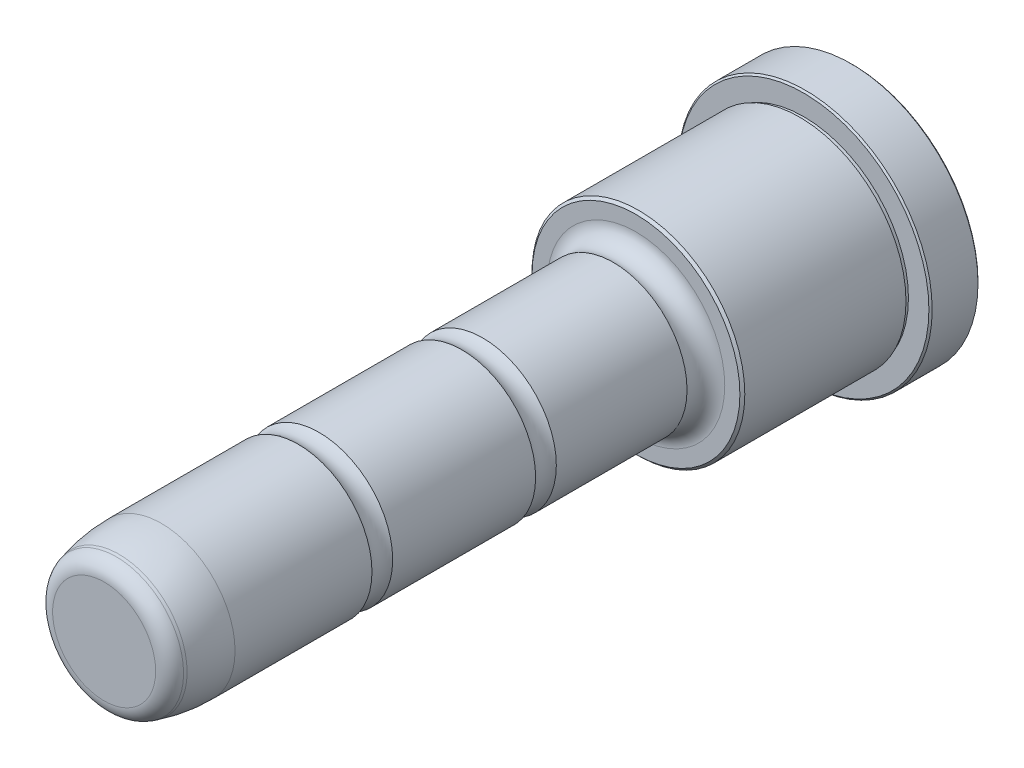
ISO-10303-21;
HEADER;
FILE_DESCRIPTION(('STEP AP214'),'2;1');
FILE_NAME('part.step','',(''),(''),'','','');
FILE_SCHEMA(('AUTOMOTIVE_DESIGN { 1 0 10303 214 1 1 1 1 }'));
ENDSEC;
DATA;
#1=APPLICATION_CONTEXT('core data for automotive mechanical design processes');
#2=APPLICATION_PROTOCOL_DEFINITION('international standard','automotive_design',2000,#1);
#3=PRODUCT_CONTEXT('',#1,'mechanical');
#4=PRODUCT('Part','Part','',(#3));
#5=PRODUCT_RELATED_PRODUCT_CATEGORY('part','',(#4));
#6=PRODUCT_DEFINITION_FORMATION('','',#4);
#7=PRODUCT_DEFINITION_CONTEXT('part definition',#1,'design');
#8=PRODUCT_DEFINITION('design','',#6,#7);
#9=PRODUCT_DEFINITION_SHAPE('','',#8);
#10=(LENGTH_UNIT() NAMED_UNIT(*) SI_UNIT(.MILLI.,.METRE.));
#11=(NAMED_UNIT(*) PLANE_ANGLE_UNIT() SI_UNIT($,.RADIAN.));
#12=(NAMED_UNIT(*) SI_UNIT($,.STERADIAN.) SOLID_ANGLE_UNIT());
#13=UNCERTAINTY_MEASURE_WITH_UNIT(LENGTH_MEASURE(1.E-05),#10,'distance_accuracy_value','');
#14=(GEOMETRIC_REPRESENTATION_CONTEXT(3) GLOBAL_UNCERTAINTY_ASSIGNED_CONTEXT((#13)) GLOBAL_UNIT_ASSIGNED_CONTEXT((#10,
#11,#12)) REPRESENTATION_CONTEXT('',''));
#15=CARTESIAN_POINT('',(0.,0.,0.));
#16=DIRECTION('',(0.,0.,1.));
#17=DIRECTION('',(1.,0.,0.));
#18=AXIS2_PLACEMENT_3D('',#15,#16,#17);
#19=CARTESIAN_POINT('',(0.,0.,0.250000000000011));
#20=DIRECTION('',(0.,0.,1.));
#21=DIRECTION('',(1.,0.,0.));
#22=AXIS2_PLACEMENT_3D('',#19,#20,#21);
#23=CYLINDRICAL_SURFACE('',#22,8.99999999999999);
#24=CARTESIAN_POINT('',(0.,0.,29.5099342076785));
#25=DIRECTION('',(0.,0.,1.));
#26=DIRECTION('',(1.,0.,0.));
#27=AXIS2_PLACEMENT_3D('',#24,#25,#26);
#28=CIRCLE('',#27,9.);
#29=CARTESIAN_POINT('',(9.,0.,29.5099342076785));
#30=VERTEX_POINT('',#29);
#31=EDGE_CURVE('E10',#30,#30,#28,.T.);
#32=ORIENTED_EDGE('',*,*,#31,.T.);
#33=EDGE_LOOP('',(#32));
#34=FACE_BOUND('',#33,.T.);
#35=CARTESIAN_POINT('',(0.,0.,45.4850889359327));
#36=DIRECTION('',(0.,0.,1.));
#37=DIRECTION('',(1.,0.,0.));
#38=AXIS2_PLACEMENT_3D('',#35,#36,#37);
#39=CIRCLE('',#38,9.);
#40=CARTESIAN_POINT('',(9.,0.,45.4850889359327));
#41=VERTEX_POINT('',#40);
#42=EDGE_CURVE('E91',#41,#41,#39,.T.);
#43=ORIENTED_EDGE('',*,*,#42,.F.);
#44=EDGE_LOOP('',(#43));
#45=FACE_BOUND('',#44,.T.);
#46=ADVANCED_FACE('F32',(#34,#45),#23,.T.);
#47=CARTESIAN_POINT('',(0.,0.,28.75));
#48=DIRECTION('',(0.,0.,1.));
#49=DIRECTION('',(1.,0.,0.));
#50=AXIS2_PLACEMENT_3D('',#47,#48,#49);
#51=TOROIDAL_SURFACE('',#50,10.85,2.);
#52=ORIENTED_EDGE('',*,*,#31,.F.);
#53=EDGE_LOOP('',(#52));
#54=FACE_BOUND('',#53,.T.);
#55=CARTESIAN_POINT('',(0.,0.,26.75));
#56=DIRECTION('',(0.,0.,1.));
#57=DIRECTION('',(1.,0.,0.));
#58=AXIS2_PLACEMENT_3D('',#55,#56,#57);
#59=CIRCLE('',#58,10.85);
#60=CARTESIAN_POINT('',(10.85,0.,26.75));
#61=VERTEX_POINT('',#60);
#62=EDGE_CURVE('E82',#61,#61,#59,.T.);
#63=ORIENTED_EDGE('',*,*,#62,.T.);
#64=EDGE_LOOP('',(#63));
#65=FACE_BOUND('',#64,.T.);
#66=ADVANCED_FACE('F34',(#54,#65),#51,.F.);
#67=CARTESIAN_POINT('',(0.,0.,0.250000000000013));
#68=DIRECTION('',(0.,0.,1.));
#69=DIRECTION('',(1.,0.,0.));
#70=AXIS2_PLACEMENT_3D('',#67,#68,#69);
#71=PLANE('',#70);
#72=CARTESIAN_POINT('',(0.,0.,0.250000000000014));
#73=DIRECTION('',(0.,0.,1.));
#74=DIRECTION('',(1.,0.,0.));
#75=AXIS2_PLACEMENT_3D('',#72,#73,#74);
#76=CIRCLE('',#75,15.3);
#77=CARTESIAN_POINT('',(15.3,0.,0.250000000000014));
#78=VERTEX_POINT('',#77);
#79=EDGE_CURVE('E55',#78,#78,#76,.T.);
#80=ORIENTED_EDGE('',*,*,#79,.F.);
#81=EDGE_LOOP('',(#80));
#82=FACE_BOUND('',#81,.T.);
#83=ADVANCED_FACE('F122',(#82),#71,.F.);
#84=CARTESIAN_POINT('',(0.,0.,0.250000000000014));
#85=DIRECTION('',(0.,0.,1.));
#86=DIRECTION('',(1.,0.,0.));
#87=AXIS2_PLACEMENT_3D('',#84,#85,#86);
#88=CONICAL_SURFACE('',#87,15.3,0.785398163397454);
#89=CARTESIAN_POINT('',(0.,0.,0.450000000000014));
#90=DIRECTION('',(0.,0.,1.));
#91=DIRECTION('',(1.,0.,0.));
#92=AXIS2_PLACEMENT_3D('',#89,#90,#91);
#93=CIRCLE('',#92,15.5);
#94=CARTESIAN_POINT('',(15.5,0.,0.450000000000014));
#95=VERTEX_POINT('',#94);
#96=EDGE_CURVE('E58',#95,#95,#93,.T.);
#97=ORIENTED_EDGE('',*,*,#96,.F.);
#98=EDGE_LOOP('',(#97));
#99=FACE_BOUND('',#98,.T.);
#100=ORIENTED_EDGE('',*,*,#79,.T.);
#101=EDGE_LOOP('',(#100));
#102=FACE_BOUND('',#101,.T.);
#103=ADVANCED_FACE('F169',(#99,#102),#88,.T.);
#104=CARTESIAN_POINT('',(0.,0.,0.250000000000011));
#105=DIRECTION('',(0.,0.,1.));
#106=DIRECTION('',(1.,0.,0.));
#107=AXIS2_PLACEMENT_3D('',#104,#105,#106);
#108=CYLINDRICAL_SURFACE('',#107,15.5);
#109=CARTESIAN_POINT('',(0.,0.,6.05000000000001));
#110=DIRECTION('',(0.,0.,1.));
#111=DIRECTION('',(1.,0.,0.));
#112=AXIS2_PLACEMENT_3D('',#109,#110,#111);
#113=CIRCLE('',#112,15.5);
#114=CARTESIAN_POINT('',(15.5,0.,6.05000000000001));
#115=VERTEX_POINT('',#114);
#116=EDGE_CURVE('E61',#115,#115,#113,.T.);
#117=ORIENTED_EDGE('',*,*,#116,.F.);
#118=EDGE_LOOP('',(#117));
#119=FACE_BOUND('',#118,.T.);
#120=ORIENTED_EDGE('',*,*,#96,.T.);
#121=EDGE_LOOP('',(#120));
#122=FACE_BOUND('',#121,.T.);
#123=ADVANCED_FACE('F165',(#119,#122),#108,.T.);
#124=CARTESIAN_POINT('',(0.,0.,6.05000000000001));
#125=DIRECTION('',(0.,0.,-1.));
#126=DIRECTION('',(-1.,0.,0.));
#127=AXIS2_PLACEMENT_3D('',#124,#125,#126);
#128=CONICAL_SURFACE('',#127,15.5,0.785398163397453);
#129=CARTESIAN_POINT('',(0.,0.,6.25000000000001));
#130=DIRECTION('',(0.,0.,1.));
#131=DIRECTION('',(1.,0.,0.));
#132=AXIS2_PLACEMENT_3D('',#129,#130,#131);
#133=CIRCLE('',#132,15.3);
#134=CARTESIAN_POINT('',(15.3,0.,6.25000000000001));
#135=VERTEX_POINT('',#134);
#136=EDGE_CURVE('E64',#135,#135,#133,.T.);
#137=ORIENTED_EDGE('',*,*,#136,.F.);
#138=EDGE_LOOP('',(#137));
#139=FACE_BOUND('',#138,.T.);
#140=ORIENTED_EDGE('',*,*,#116,.T.);
#141=EDGE_LOOP('',(#140));
#142=FACE_BOUND('',#141,.T.);
#143=ADVANCED_FACE('F161',(#139,#142),#128,.T.);
#144=CARTESIAN_POINT('',(0.,15.3,6.25000000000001));
#145=DIRECTION('',(0.,0.,-1.));
#146=DIRECTION('',(-1.,0.,0.));
#147=AXIS2_PLACEMENT_3D('',#144,#145,#146);
#148=PLANE('',#147);
#149=CARTESIAN_POINT('',(0.,0.,6.25000000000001));
#150=DIRECTION('',(0.,0.,1.));
#151=DIRECTION('',(1.,0.,0.));
#152=AXIS2_PLACEMENT_3D('',#149,#150,#151);
#153=CIRCLE('',#152,12.8);
#154=CARTESIAN_POINT('',(12.8,0.,6.25000000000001));
#155=VERTEX_POINT('',#154);
#156=EDGE_CURVE('E67',#155,#155,#153,.T.);
#157=ORIENTED_EDGE('',*,*,#156,.F.);
#158=EDGE_LOOP('',(#157));
#159=FACE_BOUND('',#158,.T.);
#160=ORIENTED_EDGE('',*,*,#136,.T.);
#161=EDGE_LOOP('',(#160));
#162=FACE_BOUND('',#161,.T.);
#163=ADVANCED_FACE('F157',(#159,#162),#148,.F.);
#164=CARTESIAN_POINT('',(0.,0.,0.250000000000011));
#165=DIRECTION('',(0.,0.,1.));
#166=DIRECTION('',(1.,0.,0.));
#167=AXIS2_PLACEMENT_3D('',#164,#165,#166);
#168=CYLINDRICAL_SURFACE('',#167,12.8);
#169=CARTESIAN_POINT('',(0.,0.,6.75000000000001));
#170=DIRECTION('',(0.,0.,1.));
#171=DIRECTION('',(1.,0.,0.));
#172=AXIS2_PLACEMENT_3D('',#169,#170,#171);
#173=CIRCLE('',#172,12.8);
#174=CARTESIAN_POINT('',(12.8,0.,6.75000000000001));
#175=VERTEX_POINT('',#174);
#176=EDGE_CURVE('E70',#175,#175,#173,.T.);
#177=ORIENTED_EDGE('',*,*,#176,.F.);
#178=EDGE_LOOP('',(#177));
#179=FACE_BOUND('',#178,.T.);
#180=ORIENTED_EDGE('',*,*,#156,.T.);
#181=EDGE_LOOP('',(#180));
#182=FACE_BOUND('',#181,.T.);
#183=ADVANCED_FACE('F153',(#179,#182),#168,.T.);
#184=CARTESIAN_POINT('',(0.,12.8,6.75000000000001));
#185=DIRECTION('',(0.,0.,1.));
#186=DIRECTION('',(1.,0.,0.));
#187=AXIS2_PLACEMENT_3D('',#184,#185,#186);
#188=PLANE('',#187);
#189=CARTESIAN_POINT('',(0.,0.,6.75000000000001));
#190=DIRECTION('',(0.,0.,1.));
#191=DIRECTION('',(1.,0.,0.));
#192=AXIS2_PLACEMENT_3D('',#189,#190,#191);
#193=CIRCLE('',#192,13.);
#194=CARTESIAN_POINT('',(13.,0.,6.75000000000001));
#195=VERTEX_POINT('',#194);
#196=EDGE_CURVE('E73',#195,#195,#193,.T.);
#197=ORIENTED_EDGE('',*,*,#196,.F.);
#198=EDGE_LOOP('',(#197));
#199=FACE_BOUND('',#198,.T.);
#200=ORIENTED_EDGE('',*,*,#176,.T.);
#201=EDGE_LOOP('',(#200));
#202=FACE_BOUND('',#201,.T.);
#203=ADVANCED_FACE('F149',(#199,#202),#188,.F.);
#204=CARTESIAN_POINT('',(0.,0.,0.250000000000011));
#205=DIRECTION('',(0.,0.,1.));
#206=DIRECTION('',(1.,0.,0.));
#207=AXIS2_PLACEMENT_3D('',#204,#205,#206);
#208=CYLINDRICAL_SURFACE('',#207,13.);
#209=CARTESIAN_POINT('',(0.,0.,26.45));
#210=DIRECTION('',(0.,0.,1.));
#211=DIRECTION('',(1.,0.,0.));
#212=AXIS2_PLACEMENT_3D('',#209,#210,#211);
#213=CIRCLE('',#212,13.);
#214=CARTESIAN_POINT('',(13.,0.,26.45));
#215=VERTEX_POINT('',#214);
#216=EDGE_CURVE('E76',#215,#215,#213,.T.);
#217=ORIENTED_EDGE('',*,*,#216,.F.);
#218=EDGE_LOOP('',(#217));
#219=FACE_BOUND('',#218,.T.);
#220=ORIENTED_EDGE('',*,*,#196,.T.);
#221=EDGE_LOOP('',(#220));
#222=FACE_BOUND('',#221,.T.);
#223=ADVANCED_FACE('F145',(#219,#222),#208,.T.);
#224=CARTESIAN_POINT('',(0.,0.,26.45));
#225=DIRECTION('',(0.,0.,-1.));
#226=DIRECTION('',(-1.,0.,0.));
#227=AXIS2_PLACEMENT_3D('',#224,#225,#226);
#228=CONICAL_SURFACE('',#227,13.,0.785398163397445);
#229=CARTESIAN_POINT('',(0.,0.,26.75));
#230=DIRECTION('',(0.,0.,1.));
#231=DIRECTION('',(1.,0.,0.));
#232=AXIS2_PLACEMENT_3D('',#229,#230,#231);
#233=CIRCLE('',#232,12.7);
#234=CARTESIAN_POINT('',(12.7,0.,26.75));
#235=VERTEX_POINT('',#234);
#236=EDGE_CURVE('E79',#235,#235,#233,.T.);
#237=ORIENTED_EDGE('',*,*,#236,.F.);
#238=EDGE_LOOP('',(#237));
#239=FACE_BOUND('',#238,.T.);
#240=ORIENTED_EDGE('',*,*,#216,.T.);
#241=EDGE_LOOP('',(#240));
#242=FACE_BOUND('',#241,.T.);
#243=ADVANCED_FACE('F113',(#239,#242),#228,.T.);
#244=CARTESIAN_POINT('',(0.,12.7,26.75));
#245=DIRECTION('',(0.,0.,-1.));
#246=DIRECTION('',(-1.,0.,0.));
#247=AXIS2_PLACEMENT_3D('',#244,#245,#246);
#248=PLANE('',#247);
#249=ORIENTED_EDGE('',*,*,#62,.F.);
#250=EDGE_LOOP('',(#249));
#251=FACE_BOUND('',#250,.T.);
#252=ORIENTED_EDGE('',*,*,#236,.T.);
#253=EDGE_LOOP('',(#252));
#254=FACE_BOUND('',#253,.T.);
#255=ADVANCED_FACE('F103',(#251,#254),#248,.F.);
#256=CARTESIAN_POINT('',(0.,0.,46.75));
#257=DIRECTION('',(0.,0.,1.));
#258=DIRECTION('',(1.,0.,0.));
#259=AXIS2_PLACEMENT_3D('',#256,#257,#258);
#260=TOROIDAL_SURFACE('',#259,10.8000000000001,2.20000000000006);
#261=ORIENTED_EDGE('',*,*,#42,.T.);
#262=EDGE_LOOP('',(#261));
#263=FACE_BOUND('',#262,.T.);
#264=CARTESIAN_POINT('',(0.,0.,48.0149110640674));
#265=DIRECTION('',(0.,0.,1.));
#266=DIRECTION('',(1.,0.,0.));
#267=AXIS2_PLACEMENT_3D('',#264,#265,#266);
#268=CIRCLE('',#267,9.);
#269=CARTESIAN_POINT('',(9.,0.,48.0149110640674));
#270=VERTEX_POINT('',#269);
#271=EDGE_CURVE('E94',#270,#270,#268,.T.);
#272=ORIENTED_EDGE('',*,*,#271,.F.);
#273=EDGE_LOOP('',(#272));
#274=FACE_BOUND('',#273,.T.);
#275=ADVANCED_FACE('F100',(#263,#274),#260,.F.);
#276=CARTESIAN_POINT('',(0.,6.29522528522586,91.75));
#277=DIRECTION('',(0.,0.,-1.));
#278=DIRECTION('',(-1.,0.,0.));
#279=AXIS2_PLACEMENT_3D('',#276,#277,#278);
#280=PLANE('',#279);
#281=CARTESIAN_POINT('',(0.,0.,91.75));
#282=DIRECTION('',(0.,0.,1.));
#283=DIRECTION('',(1.,0.,0.));
#284=AXIS2_PLACEMENT_3D('',#281,#282,#283);
#285=CIRCLE('',#284,6.29522528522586);
#286=CARTESIAN_POINT('',(6.29522528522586,0.,91.75));
#287=VERTEX_POINT('',#286);
#288=EDGE_CURVE('E52',#287,#287,#285,.T.);
#289=ORIENTED_EDGE('',*,*,#288,.T.);
#290=EDGE_LOOP('',(#289));
#291=FACE_BOUND('',#290,.T.);
#292=ADVANCED_FACE('F102',(#291),#280,.F.);
#293=CARTESIAN_POINT('',(0.,0.,89.75));
#294=DIRECTION('',(0.,0.,1.));
#295=DIRECTION('',(1.,0.,0.));
#296=AXIS2_PLACEMENT_3D('',#293,#294,#295);
#297=TOROIDAL_SURFACE('',#296,6.29522528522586,2.00000000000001);
#298=ORIENTED_EDGE('',*,*,#288,.F.);
#299=EDGE_LOOP('',(#298));
#300=FACE_BOUND('',#299,.T.);
#301=CARTESIAN_POINT('',(0.,0.,90.267638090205));
#302=DIRECTION('',(0.,0.,1.));
#303=DIRECTION('',(1.,0.,0.));
#304=AXIS2_PLACEMENT_3D('',#301,#302,#303);
#305=CIRCLE('',#304,8.22707693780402);
#306=CARTESIAN_POINT('',(8.22707693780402,0.,90.267638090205));
#307=VERTEX_POINT('',#306);
#308=EDGE_CURVE('E47',#307,#307,#305,.T.);
#309=ORIENTED_EDGE('',*,*,#308,.T.);
#310=EDGE_LOOP('',(#309));
#311=FACE_BOUND('',#310,.T.);
#312=ADVANCED_FACE('F110',(#300,#311),#297,.T.);
#313=CARTESIAN_POINT('',(0.,0.,89.9263809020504));
#314=DIRECTION('',(0.,0.,-1.));
#315=DIRECTION('',(-1.,0.,0.));
#316=AXIS2_PLACEMENT_3D('',#313,#314,#315);
#317=CONICAL_SURFACE('',#316,8.31851652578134,0.261799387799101);
#318=ORIENTED_EDGE('',*,*,#308,.F.);
#319=EDGE_LOOP('',(#318));
#320=FACE_BOUND('',#319,.T.);
#321=CARTESIAN_POINT('',(0.,0.,89.9263809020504));
#322=DIRECTION('',(0.,0.,1.));
#323=DIRECTION('',(1.,0.,0.));
#324=AXIS2_PLACEMENT_3D('',#321,#322,#323);
#325=CIRCLE('',#324,8.31851652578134);
#326=CARTESIAN_POINT('',(8.31851652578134,0.,89.9263809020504));
#327=VERTEX_POINT('',#326);
#328=EDGE_CURVE('E43',#327,#327,#325,.T.);
#329=ORIENTED_EDGE('',*,*,#328,.T.);
#330=EDGE_LOOP('',(#329));
#331=FACE_BOUND('',#330,.T.);
#332=ADVANCED_FACE('F179',(#320,#331),#317,.T.);
#333=CARTESIAN_POINT('',(0.,0.,84.75));
#334=DIRECTION('',(0.,0.,1.));
#335=DIRECTION('',(1.,0.,0.));
#336=AXIS2_PLACEMENT_3D('',#333,#334,#335);
#337=DEGENERATE_TOROIDAL_SURFACE('',#336,11.,20.,.F.);
#338=ORIENTED_EDGE('',*,*,#328,.F.);
#339=EDGE_LOOP('',(#338));
#340=FACE_BOUND('',#339,.T.);
#341=CARTESIAN_POINT('',(0.,0.,84.75));
#342=DIRECTION('',(0.,0.,1.));
#343=DIRECTION('',(1.,0.,0.));
#344=AXIS2_PLACEMENT_3D('',#341,#342,#343);
#345=CIRCLE('',#344,8.99999999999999);
#346=CARTESIAN_POINT('',(8.99999999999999,0.,84.75));
#347=VERTEX_POINT('',#346);
#348=EDGE_CURVE('E39',#347,#347,#345,.T.);
#349=ORIENTED_EDGE('',*,*,#348,.T.);
#350=EDGE_LOOP('',(#349));
#351=FACE_BOUND('',#350,.T.);
#352=ADVANCED_FACE('F128',(#340,#351),#337,.F.);
#353=ORIENTED_EDGE('',*,*,#348,.F.);
#354=EDGE_LOOP('',(#353));
#355=FACE_BOUND('',#354,.T.);
#356=CARTESIAN_POINT('',(0.,0.,68.0149110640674));
#357=DIRECTION('',(0.,0.,1.));
#358=DIRECTION('',(1.,0.,0.));
#359=AXIS2_PLACEMENT_3D('',#356,#357,#358);
#360=CIRCLE('',#359,9.);
#361=CARTESIAN_POINT('',(9.,0.,68.0149110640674));
#362=VERTEX_POINT('',#361);
#363=EDGE_CURVE('E88',#362,#362,#360,.T.);
#364=ORIENTED_EDGE('',*,*,#363,.T.);
#365=EDGE_LOOP('',(#364));
#366=FACE_BOUND('',#365,.T.);
#367=ADVANCED_FACE('F118',(#355,#366),#23,.T.);
#368=CARTESIAN_POINT('',(0.,0.,66.75));
#369=DIRECTION('',(0.,0.,1.));
#370=DIRECTION('',(1.,0.,0.));
#371=AXIS2_PLACEMENT_3D('',#368,#369,#370);
#372=TOROIDAL_SURFACE('',#371,10.8000000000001,2.20000000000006);
#373=CARTESIAN_POINT('',(0.,0.,65.4850889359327));
#374=DIRECTION('',(0.,0.,1.));
#375=DIRECTION('',(1.,0.,0.));
#376=AXIS2_PLACEMENT_3D('',#373,#374,#375);
#377=CIRCLE('',#376,9.);
#378=CARTESIAN_POINT('',(9.,0.,65.4850889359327));
#379=VERTEX_POINT('',#378);
#380=EDGE_CURVE('E85',#379,#379,#377,.T.);
#381=ORIENTED_EDGE('',*,*,#380,.T.);
#382=EDGE_LOOP('',(#381));
#383=FACE_BOUND('',#382,.T.);
#384=ORIENTED_EDGE('',*,*,#363,.F.);
#385=EDGE_LOOP('',(#384));
#386=FACE_BOUND('',#385,.T.);
#387=ADVANCED_FACE('F127',(#383,#386),#372,.F.);
#388=ORIENTED_EDGE('',*,*,#380,.F.);
#389=EDGE_LOOP('',(#388));
#390=FACE_BOUND('',#389,.T.);
#391=ORIENTED_EDGE('',*,*,#271,.T.);
#392=EDGE_LOOP('',(#391));
#393=FACE_BOUND('',#392,.T.);
#394=ADVANCED_FACE('F98',(#390,#393),#23,.T.);
#395=CLOSED_SHELL('',(#46,#66,#83,#103,#123,#143,#163,#183,#203,#223,#243,#255,#275,#292,#312,
#332,#352,#367,#387,#394));
#396=MANIFOLD_SOLID_BREP('B2',#395);
#397=ADVANCED_BREP_SHAPE_REPRESENTATION('',(#18,#396),#14);
#398=SHAPE_DEFINITION_REPRESENTATION(#9,#397);
ENDSEC;
END-ISO-10303-21;
